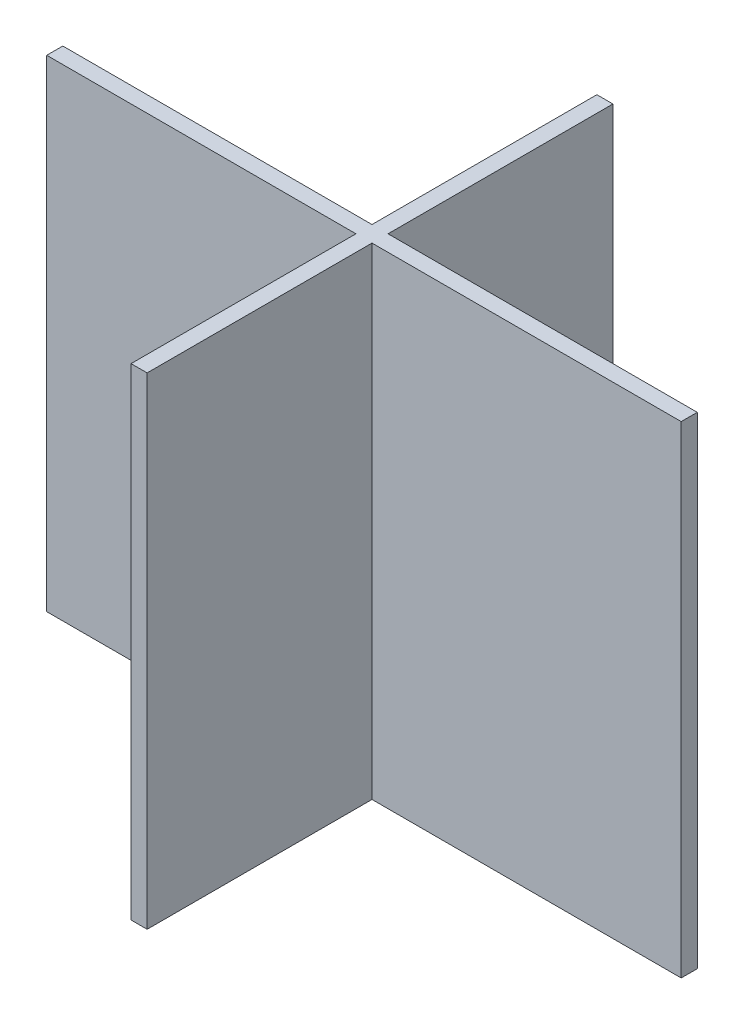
from build123d import *

# Parameters (mm, degrees)
SKETCH_1_W      = 38.5
SKETCH_1_H      = 2
SKETCH_1_W_2    = 2
SKETCH_1_H_2    = 28
EXTRUDE_1_DEPTH = 60


with BuildPart() as part:
    # Sketch 1 → Extrude 1 (new body)
    with BuildSketch(Plane(origin=(0, 0, 0), x_dir=(1, 0, 0), z_dir=(0, 1, 0))):
        with Locations((-20.25, 0)):
            Rectangle(SKETCH_1_W, SKETCH_1_H)
        with Locations((0, -15)):
            Rectangle(SKETCH_1_W_2, SKETCH_1_H_2)
        with Locations((0, 15)):
            Rectangle(SKETCH_1_W_2, SKETCH_1_H_2)
        Rectangle(SKETCH_1_W_2, SKETCH_1_H)
        with Locations((20.25, 0)):
            Rectangle(SKETCH_1_W, SKETCH_1_H)
    extrude(amount=EXTRUDE_1_DEPTH)


solid = part.part
